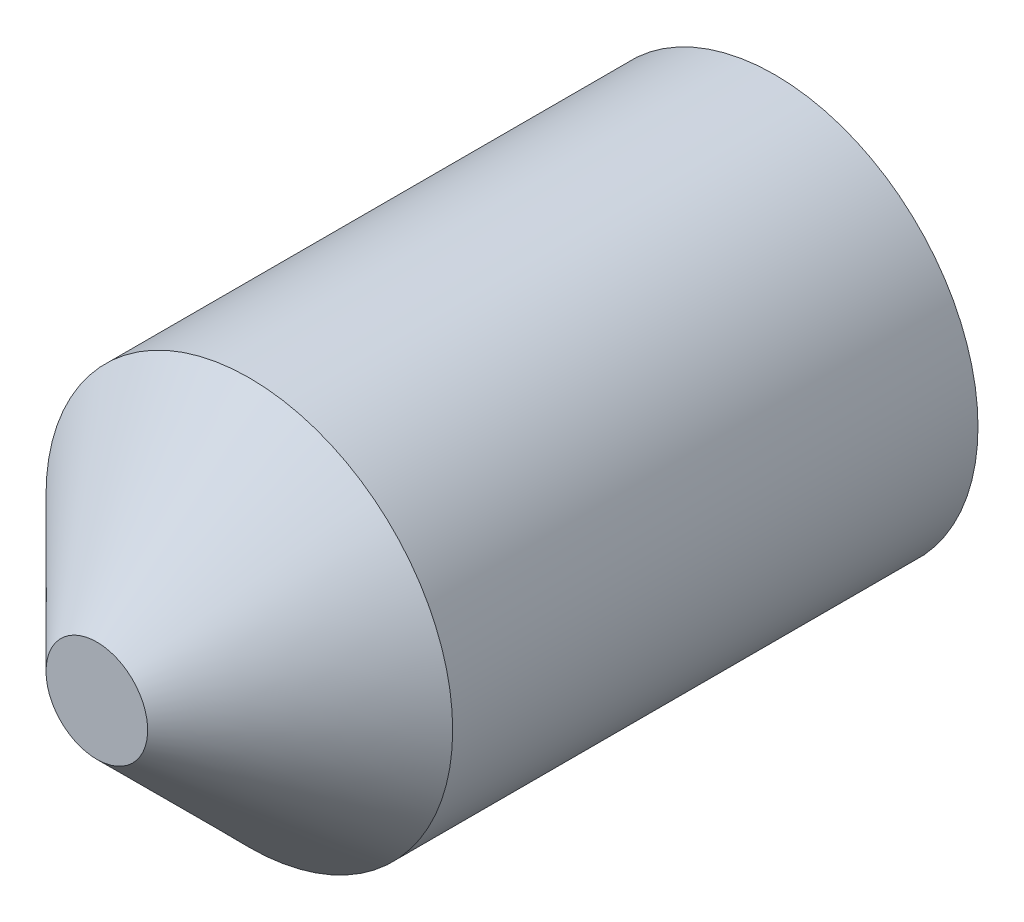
from build123d import *

# Parameters (mm, degrees)
ESQUISSE1_R             = 3
EXTRUSION1_DEPTH        = 10
CHANFREIN2_SIZE         = 2.25
ENL_V_MAT_EXTRU_1_DEPTH = 3


with BuildPart() as part:
    # Esquisse1 → Extrusion1 (new body)
    with BuildSketch(Plane.XY):
        Circle(ESQUISSE1_R)
    extrude(amount=EXTRUSION1_DEPTH)

    # Chanfrein2
    chanfrein2_edges = [part.edges().sort_by_distance(p)[0] for p in [
        (-3, 0, 10),
    ]]
    chamfer(chanfrein2_edges, length=CHANFREIN2_SIZE)

    # Esquisse2 → Enl_v. mat.-Extru.1 (cut)
    with BuildSketch(Plane(origin=(0, 0, 0), x_dir=(-1, 0, 0), z_dir=(0, 0, -1))):
        Polygon((0, -1.732050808), (1.5, -0.866025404), (1.5, 0.866025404), (0, 1.732050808), (-1.5, 0.866025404), (-1.5, -0.866025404), align=None)
    extrude(amount=-ENL_V_MAT_EXTRU_1_DEPTH, mode=Mode.SUBTRACT)


solid = part.part
